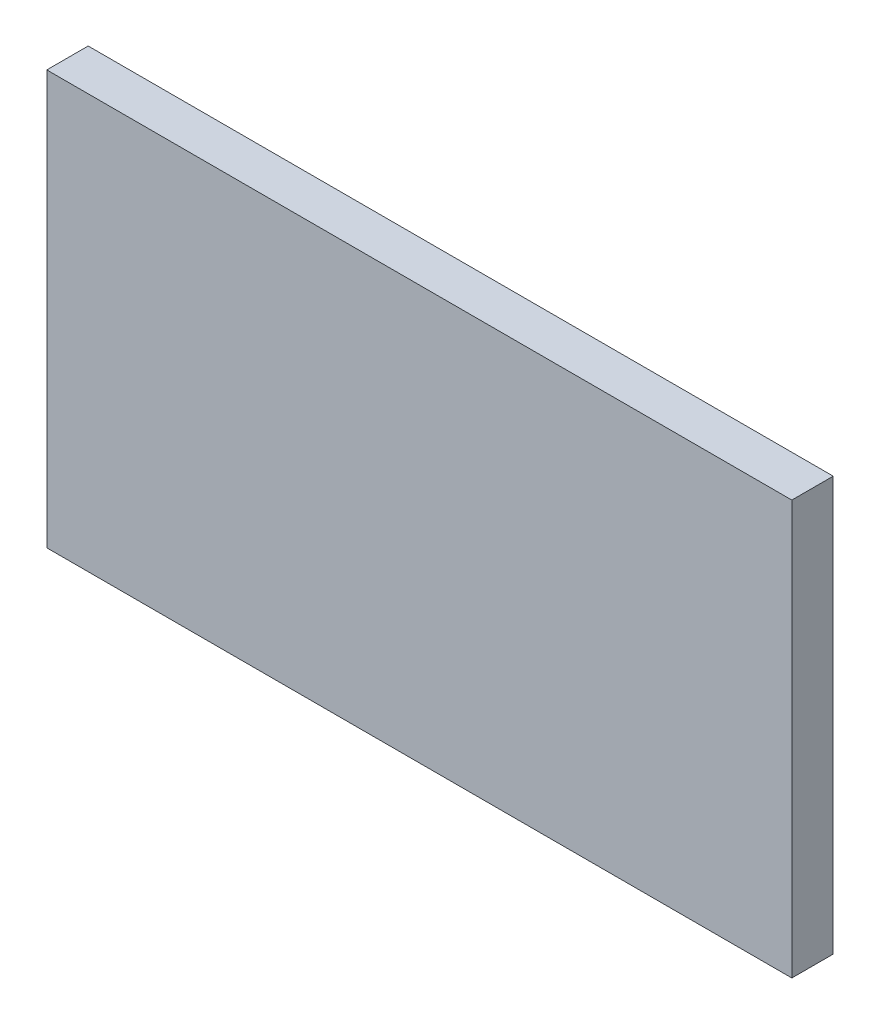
ISO-10303-21;
HEADER;
FILE_DESCRIPTION(('STEP AP214'),'2;1');
FILE_NAME('part.step','',(''),(''),'','','');
FILE_SCHEMA(('AUTOMOTIVE_DESIGN { 1 0 10303 214 1 1 1 1 }'));
ENDSEC;
DATA;
#1=APPLICATION_CONTEXT('core data for automotive mechanical design processes');
#2=APPLICATION_PROTOCOL_DEFINITION('international standard','automotive_design',2000,#1);
#3=PRODUCT_CONTEXT('',#1,'mechanical');
#4=PRODUCT('Part','Part','',(#3));
#5=PRODUCT_RELATED_PRODUCT_CATEGORY('part','',(#4));
#6=PRODUCT_DEFINITION_FORMATION('','',#4);
#7=PRODUCT_DEFINITION_CONTEXT('part definition',#1,'design');
#8=PRODUCT_DEFINITION('design','',#6,#7);
#9=PRODUCT_DEFINITION_SHAPE('','',#8);
#10=(LENGTH_UNIT() NAMED_UNIT(*) SI_UNIT(.MILLI.,.METRE.));
#11=(NAMED_UNIT(*) PLANE_ANGLE_UNIT() SI_UNIT($,.RADIAN.));
#12=(NAMED_UNIT(*) SI_UNIT($,.STERADIAN.) SOLID_ANGLE_UNIT());
#13=UNCERTAINTY_MEASURE_WITH_UNIT(LENGTH_MEASURE(1.E-05),#10,'distance_accuracy_value','');
#14=(GEOMETRIC_REPRESENTATION_CONTEXT(3) GLOBAL_UNCERTAINTY_ASSIGNED_CONTEXT((#13)) GLOBAL_UNIT_ASSIGNED_CONTEXT((#10,
#11,#12)) REPRESENTATION_CONTEXT('',''));
#15=CARTESIAN_POINT('',(0.,0.,0.));
#16=DIRECTION('',(0.,0.,1.));
#17=DIRECTION('',(1.,0.,0.));
#18=AXIS2_PLACEMENT_3D('',#15,#16,#17);
#19=CARTESIAN_POINT('',(0.,0.,0.635));
#20=DIRECTION('',(1.,0.,0.));
#21=DIRECTION('',(0.,0.,-1.));
#22=AXIS2_PLACEMENT_3D('',#19,#20,#21);
#23=PLANE('',#22);
#24=DIRECTION('',(0.,-1.,0.));
#25=VECTOR('',#24,1.);
#26=CARTESIAN_POINT('',(0.,0.,0.));
#27=LINE('',#26,#25);
#28=CARTESIAN_POINT('',(0.,6.35,0.));
#29=VERTEX_POINT('',#28);
#30=CARTESIAN_POINT('',(0.,0.,0.));
#31=VERTEX_POINT('',#30);
#32=EDGE_CURVE('E94',#29,#31,#27,.T.);
#33=ORIENTED_EDGE('',*,*,#32,.T.);
#34=DIRECTION('',(0.,0.,-1.));
#35=VECTOR('',#34,1.);
#36=CARTESIAN_POINT('',(0.,0.,0.635));
#37=LINE('',#36,#35);
#38=CARTESIAN_POINT('',(0.,0.,0.635));
#39=VERTEX_POINT('',#38);
#40=EDGE_CURVE('E11',#39,#31,#37,.T.);
#41=ORIENTED_EDGE('',*,*,#40,.F.);
#42=DIRECTION('',(0.,-1.,0.));
#43=VECTOR('',#42,1.);
#44=CARTESIAN_POINT('',(0.,0.,0.635));
#45=LINE('',#44,#43);
#46=CARTESIAN_POINT('',(0.,6.35,0.635));
#47=VERTEX_POINT('',#46);
#48=EDGE_CURVE('E82',#47,#39,#45,.T.);
#49=ORIENTED_EDGE('',*,*,#48,.F.);
#50=DIRECTION('',(0.,0.,-1.));
#51=VECTOR('',#50,1.);
#52=CARTESIAN_POINT('',(0.,6.35,0.635));
#53=LINE('',#52,#51);
#54=EDGE_CURVE('E90',#47,#29,#53,.T.);
#55=ORIENTED_EDGE('',*,*,#54,.T.);
#56=EDGE_LOOP('',(#33,#41,#49,#55));
#57=FACE_BOUND('',#56,.T.);
#58=ADVANCED_FACE('F31',(#57),#23,.F.);
#59=CARTESIAN_POINT('',(0.,0.,0.635));
#60=DIRECTION('',(0.,1.,0.));
#61=DIRECTION('',(0.,0.,1.));
#62=AXIS2_PLACEMENT_3D('',#59,#60,#61);
#63=PLANE('',#62);
#64=DIRECTION('',(1.,0.,0.));
#65=VECTOR('',#64,1.);
#66=CARTESIAN_POINT('',(0.,0.,0.));
#67=LINE('',#66,#65);
#68=CARTESIAN_POINT('',(11.43,0.,0.));
#69=VERTEX_POINT('',#68);
#70=EDGE_CURVE('E86',#31,#69,#67,.T.);
#71=ORIENTED_EDGE('',*,*,#70,.T.);
#72=DIRECTION('',(0.,0.,-1.));
#73=VECTOR('',#72,1.);
#74=CARTESIAN_POINT('',(11.43,0.,0.635));
#75=LINE('',#74,#73);
#76=CARTESIAN_POINT('',(11.43,0.,0.635));
#77=VERTEX_POINT('',#76);
#78=EDGE_CURVE('E39',#77,#69,#75,.T.);
#79=ORIENTED_EDGE('',*,*,#78,.F.);
#80=DIRECTION('',(1.,0.,0.));
#81=VECTOR('',#80,1.);
#82=CARTESIAN_POINT('',(0.,0.,0.635));
#83=LINE('',#82,#81);
#84=EDGE_CURVE('E77',#39,#77,#83,.T.);
#85=ORIENTED_EDGE('',*,*,#84,.F.);
#86=ORIENTED_EDGE('',*,*,#40,.T.);
#87=EDGE_LOOP('',(#71,#79,#85,#86));
#88=FACE_BOUND('',#87,.T.);
#89=ADVANCED_FACE('F85',(#88),#63,.F.);
#90=CARTESIAN_POINT('',(11.43,0.,0.635));
#91=DIRECTION('',(-1.,0.,0.));
#92=DIRECTION('',(0.,0.,1.));
#93=AXIS2_PLACEMENT_3D('',#90,#91,#92);
#94=PLANE('',#93);
#95=DIRECTION('',(0.,1.,0.));
#96=VECTOR('',#95,1.);
#97=CARTESIAN_POINT('',(11.43,0.,0.));
#98=LINE('',#97,#96);
#99=CARTESIAN_POINT('',(11.43,6.35,0.));
#100=VERTEX_POINT('',#99);
#101=EDGE_CURVE('E64',#69,#100,#98,.T.);
#102=ORIENTED_EDGE('',*,*,#101,.T.);
#103=DIRECTION('',(0.,0.,-1.));
#104=VECTOR('',#103,1.);
#105=CARTESIAN_POINT('',(11.43,6.35,0.635));
#106=LINE('',#105,#104);
#107=CARTESIAN_POINT('',(11.43,6.35,0.635));
#108=VERTEX_POINT('',#107);
#109=EDGE_CURVE('E87',#108,#100,#106,.T.);
#110=ORIENTED_EDGE('',*,*,#109,.F.);
#111=DIRECTION('',(0.,1.,0.));
#112=VECTOR('',#111,1.);
#113=CARTESIAN_POINT('',(11.43,0.,0.635));
#114=LINE('',#113,#112);
#115=EDGE_CURVE('E80',#77,#108,#114,.T.);
#116=ORIENTED_EDGE('',*,*,#115,.F.);
#117=ORIENTED_EDGE('',*,*,#78,.T.);
#118=EDGE_LOOP('',(#102,#110,#116,#117));
#119=FACE_BOUND('',#118,.T.);
#120=ADVANCED_FACE('F88',(#119),#94,.F.);
#121=CARTESIAN_POINT('',(0.,6.35,0.635));
#122=DIRECTION('',(0.,-1.,0.));
#123=DIRECTION('',(0.,0.,-1.));
#124=AXIS2_PLACEMENT_3D('',#121,#122,#123);
#125=PLANE('',#124);
#126=DIRECTION('',(-1.,0.,0.));
#127=VECTOR('',#126,1.);
#128=CARTESIAN_POINT('',(0.,6.35,0.));
#129=LINE('',#128,#127);
#130=EDGE_CURVE('E70',#100,#29,#129,.T.);
#131=ORIENTED_EDGE('',*,*,#130,.T.);
#132=ORIENTED_EDGE('',*,*,#54,.F.);
#133=DIRECTION('',(-1.,0.,0.));
#134=VECTOR('',#133,1.);
#135=CARTESIAN_POINT('',(0.,6.35,0.635));
#136=LINE('',#135,#134);
#137=EDGE_CURVE('E47',#108,#47,#136,.T.);
#138=ORIENTED_EDGE('',*,*,#137,.F.);
#139=ORIENTED_EDGE('',*,*,#109,.T.);
#140=EDGE_LOOP('',(#131,#132,#138,#139));
#141=FACE_BOUND('',#140,.T.);
#142=ADVANCED_FACE('F101',(#141),#125,.F.);
#143=CARTESIAN_POINT('',(0.,6.35,0.635));
#144=DIRECTION('',(0.,0.,-1.));
#145=DIRECTION('',(-1.,0.,0.));
#146=AXIS2_PLACEMENT_3D('',#143,#144,#145);
#147=PLANE('',#146);
#148=ORIENTED_EDGE('',*,*,#48,.T.);
#149=ORIENTED_EDGE('',*,*,#84,.T.);
#150=ORIENTED_EDGE('',*,*,#115,.T.);
#151=ORIENTED_EDGE('',*,*,#137,.T.);
#152=EDGE_LOOP('',(#148,#149,#150,#151));
#153=FACE_BOUND('',#152,.T.);
#154=ADVANCED_FACE('F78',(#153),#147,.F.);
#155=CARTESIAN_POINT('',(0.,6.35,0.));
#156=DIRECTION('',(0.,0.,-1.));
#157=DIRECTION('',(-1.,0.,0.));
#158=AXIS2_PLACEMENT_3D('',#155,#156,#157);
#159=PLANE('',#158);
#160=ORIENTED_EDGE('',*,*,#32,.F.);
#161=ORIENTED_EDGE('',*,*,#130,.F.);
#162=ORIENTED_EDGE('',*,*,#101,.F.);
#163=ORIENTED_EDGE('',*,*,#70,.F.);
#164=EDGE_LOOP('',(#160,#161,#162,#163));
#165=FACE_BOUND('',#164,.T.);
#166=ADVANCED_FACE('F104',(#165),#159,.T.);
#167=CLOSED_SHELL('',(#58,#89,#120,#142,#154,#166));
#168=MANIFOLD_SOLID_BREP('B2',#167);
#169=ADVANCED_BREP_SHAPE_REPRESENTATION('',(#18,#168),#14);
#170=SHAPE_DEFINITION_REPRESENTATION(#9,#169);
ENDSEC;
END-ISO-10303-21;
